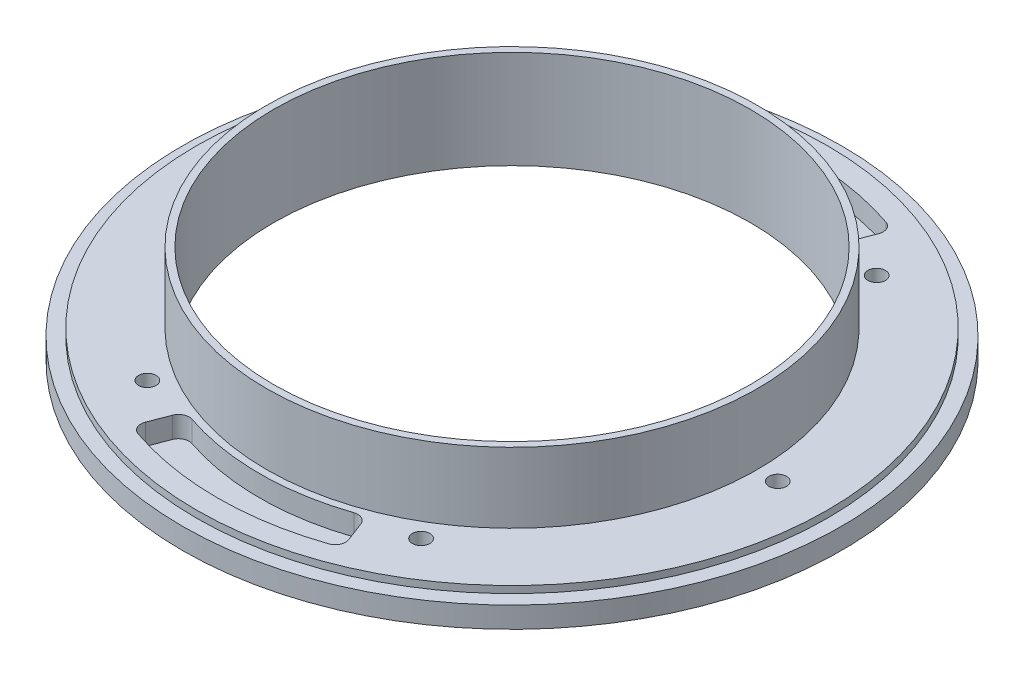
ISO-10303-21;
HEADER;
FILE_DESCRIPTION(('STEP AP214'),'2;1');
FILE_NAME('part.step','',(''),(''),'','','');
FILE_SCHEMA(('AUTOMOTIVE_DESIGN { 1 0 10303 214 1 1 1 1 }'));
ENDSEC;
DATA;
#1=APPLICATION_CONTEXT('core data for automotive mechanical design processes');
#2=APPLICATION_PROTOCOL_DEFINITION('international standard','automotive_design',2000,#1);
#3=PRODUCT_CONTEXT('',#1,'mechanical');
#4=PRODUCT('Part','Part','',(#3));
#5=PRODUCT_RELATED_PRODUCT_CATEGORY('part','',(#4));
#6=PRODUCT_DEFINITION_FORMATION('','',#4);
#7=PRODUCT_DEFINITION_CONTEXT('part definition',#1,'design');
#8=PRODUCT_DEFINITION('design','',#6,#7);
#9=PRODUCT_DEFINITION_SHAPE('','',#8);
#10=(LENGTH_UNIT() NAMED_UNIT(*) SI_UNIT(.MILLI.,.METRE.));
#11=(NAMED_UNIT(*) PLANE_ANGLE_UNIT() SI_UNIT($,.RADIAN.));
#12=(NAMED_UNIT(*) SI_UNIT($,.STERADIAN.) SOLID_ANGLE_UNIT());
#13=UNCERTAINTY_MEASURE_WITH_UNIT(LENGTH_MEASURE(1.E-05),#10,'distance_accuracy_value','');
#14=(GEOMETRIC_REPRESENTATION_CONTEXT(3) GLOBAL_UNCERTAINTY_ASSIGNED_CONTEXT((#13)) GLOBAL_UNIT_ASSIGNED_CONTEXT((#10,
#11,#12)) REPRESENTATION_CONTEXT('',''));
#15=CARTESIAN_POINT('',(0.,0.,0.));
#16=DIRECTION('',(0.,0.,1.));
#17=DIRECTION('',(1.,0.,0.));
#18=AXIS2_PLACEMENT_3D('',#15,#16,#17);
#19=CARTESIAN_POINT('',(-19.5199430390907,0.,-32.4866406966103));
#20=DIRECTION('',(0.,1.,0.));
#21=DIRECTION('',(0.,0.,1.));
#22=AXIS2_PLACEMENT_3D('',#19,#20,#21);
#23=CYLINDRICAL_SURFACE('',#22,1.25);
#24=CARTESIAN_POINT('',(-19.5199430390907,4.,-32.4866406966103));
#25=DIRECTION('',(0.,1.,0.));
#26=DIRECTION('',(0.,0.,1.));
#27=AXIS2_PLACEMENT_3D('',#24,#25,#26);
#28=CIRCLE('',#27,1.25);
#29=CARTESIAN_POINT('',(-19.5199430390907,4.,-31.2366406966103));
#30=VERTEX_POINT('',#29);
#31=EDGE_CURVE('E251',#30,#30,#28,.T.);
#32=ORIENTED_EDGE('',*,*,#31,.T.);
#33=EDGE_LOOP('',(#32));
#34=FACE_BOUND('',#33,.T.);
#35=CARTESIAN_POINT('',(-19.5199430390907,2.,-32.4866406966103));
#36=DIRECTION('',(0.,-1.,0.));
#37=DIRECTION('',(0.,0.,-1.));
#38=AXIS2_PLACEMENT_3D('',#35,#36,#37);
#39=CIRCLE('',#38,1.25);
#40=CARTESIAN_POINT('',(-19.5199430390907,2.,-33.7366406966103));
#41=VERTEX_POINT('',#40);
#42=EDGE_CURVE('E255',#41,#41,#39,.F.);
#43=ORIENTED_EDGE('',*,*,#42,.F.);
#44=EDGE_LOOP('',(#43));
#45=FACE_BOUND('',#44,.T.);
#46=ADVANCED_FACE('F37',(#34,#45),#23,.F.);
#47=CARTESIAN_POINT('',(19.5199430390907,0.,32.4866406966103));
#48=DIRECTION('',(0.,1.,0.));
#49=DIRECTION('',(0.,0.,1.));
#50=AXIS2_PLACEMENT_3D('',#47,#48,#49);
#51=CYLINDRICAL_SURFACE('',#50,1.25);
#52=CARTESIAN_POINT('',(19.5199430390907,4.,32.4866406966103));
#53=DIRECTION('',(0.,1.,0.));
#54=DIRECTION('',(0.,0.,1.));
#55=AXIS2_PLACEMENT_3D('',#52,#53,#54);
#56=CIRCLE('',#55,1.25);
#57=CARTESIAN_POINT('',(19.5199430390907,4.,33.7366406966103));
#58=VERTEX_POINT('',#57);
#59=EDGE_CURVE('E254',#58,#58,#56,.T.);
#60=ORIENTED_EDGE('',*,*,#59,.T.);
#61=EDGE_LOOP('',(#60));
#62=FACE_BOUND('',#61,.T.);
#63=CARTESIAN_POINT('',(19.5199430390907,2.,32.4866406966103));
#64=DIRECTION('',(0.,-1.,0.));
#65=DIRECTION('',(0.,0.,-1.));
#66=AXIS2_PLACEMENT_3D('',#63,#64,#65);
#67=CIRCLE('',#66,1.25);
#68=CARTESIAN_POINT('',(19.5199430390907,2.,31.2366406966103));
#69=VERTEX_POINT('',#68);
#70=EDGE_CURVE('E280',#69,#69,#67,.F.);
#71=ORIENTED_EDGE('',*,*,#70,.F.);
#72=EDGE_LOOP('',(#71));
#73=FACE_BOUND('',#72,.T.);
#74=ADVANCED_FACE('F426',(#62,#73),#51,.F.);
#75=CARTESIAN_POINT('',(19.5199430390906,0.,-32.4866406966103));
#76=DIRECTION('',(0.,1.,0.));
#77=DIRECTION('',(0.,0.,1.));
#78=AXIS2_PLACEMENT_3D('',#75,#76,#77);
#79=CYLINDRICAL_SURFACE('',#78,1.25);
#80=CARTESIAN_POINT('',(19.5199430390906,4.,-32.4866406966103));
#81=DIRECTION('',(0.,1.,0.));
#82=DIRECTION('',(0.,0.,1.));
#83=AXIS2_PLACEMENT_3D('',#80,#81,#82);
#84=CIRCLE('',#83,1.25);
#85=CARTESIAN_POINT('',(19.5199430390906,4.,-31.2366406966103));
#86=VERTEX_POINT('',#85);
#87=EDGE_CURVE('E258',#86,#86,#84,.T.);
#88=ORIENTED_EDGE('',*,*,#87,.T.);
#89=EDGE_LOOP('',(#88));
#90=FACE_BOUND('',#89,.T.);
#91=CARTESIAN_POINT('',(19.5199430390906,2.,-32.4866406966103));
#92=DIRECTION('',(0.,-1.,0.));
#93=DIRECTION('',(0.,0.,-1.));
#94=AXIS2_PLACEMENT_3D('',#91,#92,#93);
#95=CIRCLE('',#94,1.25);
#96=CARTESIAN_POINT('',(19.5199430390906,2.,-33.7366406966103));
#97=VERTEX_POINT('',#96);
#98=EDGE_CURVE('E277',#97,#97,#95,.F.);
#99=ORIENTED_EDGE('',*,*,#98,.F.);
#100=EDGE_LOOP('',(#99));
#101=FACE_BOUND('',#100,.T.);
#102=ADVANCED_FACE('F433',(#90,#101),#79,.F.);
#103=CARTESIAN_POINT('',(-37.9,0.,0.));
#104=DIRECTION('',(0.,1.,0.));
#105=DIRECTION('',(0.,0.,1.));
#106=AXIS2_PLACEMENT_3D('',#103,#104,#105);
#107=CYLINDRICAL_SURFACE('',#106,1.25);
#108=CARTESIAN_POINT('',(-37.9,4.,0.));
#109=DIRECTION('',(0.,1.,0.));
#110=DIRECTION('',(0.,0.,1.));
#111=AXIS2_PLACEMENT_3D('',#108,#109,#110);
#112=CIRCLE('',#111,1.25);
#113=CARTESIAN_POINT('',(-37.9,4.,1.25000000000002));
#114=VERTEX_POINT('',#113);
#115=EDGE_CURVE('E261',#114,#114,#112,.T.);
#116=ORIENTED_EDGE('',*,*,#115,.T.);
#117=EDGE_LOOP('',(#116));
#118=FACE_BOUND('',#117,.T.);
#119=CARTESIAN_POINT('',(-37.9,2.,0.));
#120=DIRECTION('',(0.,-1.,0.));
#121=DIRECTION('',(0.,0.,-1.));
#122=AXIS2_PLACEMENT_3D('',#119,#120,#121);
#123=CIRCLE('',#122,1.25);
#124=CARTESIAN_POINT('',(-37.9,2.,-1.24999999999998));
#125=VERTEX_POINT('',#124);
#126=EDGE_CURVE('E274',#125,#125,#123,.F.);
#127=ORIENTED_EDGE('',*,*,#126,.F.);
#128=EDGE_LOOP('',(#127));
#129=FACE_BOUND('',#128,.T.);
#130=ADVANCED_FACE('F439',(#118,#129),#107,.F.);
#131=CARTESIAN_POINT('',(37.9,0.,0.));
#132=DIRECTION('',(0.,1.,0.));
#133=DIRECTION('',(0.,0.,1.));
#134=AXIS2_PLACEMENT_3D('',#131,#132,#133);
#135=CYLINDRICAL_SURFACE('',#134,1.25);
#136=CARTESIAN_POINT('',(37.9,4.,0.));
#137=DIRECTION('',(0.,1.,0.));
#138=DIRECTION('',(0.,0.,1.));
#139=AXIS2_PLACEMENT_3D('',#136,#137,#138);
#140=CIRCLE('',#139,1.25);
#141=CARTESIAN_POINT('',(37.9,4.,1.24999999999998));
#142=VERTEX_POINT('',#141);
#143=EDGE_CURVE('E264',#142,#142,#140,.T.);
#144=ORIENTED_EDGE('',*,*,#143,.T.);
#145=EDGE_LOOP('',(#144));
#146=FACE_BOUND('',#145,.T.);
#147=CARTESIAN_POINT('',(37.9,2.,0.));
#148=DIRECTION('',(0.,-1.,0.));
#149=DIRECTION('',(0.,0.,-1.));
#150=AXIS2_PLACEMENT_3D('',#147,#148,#149);
#151=CIRCLE('',#150,1.25);
#152=CARTESIAN_POINT('',(37.9,2.,-1.25000000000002));
#153=VERTEX_POINT('',#152);
#154=EDGE_CURVE('E271',#153,#153,#151,.F.);
#155=ORIENTED_EDGE('',*,*,#154,.F.);
#156=EDGE_LOOP('',(#155));
#157=FACE_BOUND('',#156,.T.);
#158=ADVANCED_FACE('F600',(#146,#157),#135,.F.);
#159=CARTESIAN_POINT('',(-19.5199430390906,0.,32.4866406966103));
#160=DIRECTION('',(0.,1.,0.));
#161=DIRECTION('',(0.,0.,1.));
#162=AXIS2_PLACEMENT_3D('',#159,#160,#161);
#163=CYLINDRICAL_SURFACE('',#162,1.25);
#164=CARTESIAN_POINT('',(-19.5199430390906,4.,32.4866406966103));
#165=DIRECTION('',(0.,1.,0.));
#166=DIRECTION('',(0.,0.,1.));
#167=AXIS2_PLACEMENT_3D('',#164,#165,#166);
#168=CIRCLE('',#167,1.25);
#169=CARTESIAN_POINT('',(-19.5199430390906,4.,33.7366406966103));
#170=VERTEX_POINT('',#169);
#171=EDGE_CURVE('E230',#170,#170,#168,.T.);
#172=ORIENTED_EDGE('',*,*,#171,.T.);
#173=EDGE_LOOP('',(#172));
#174=FACE_BOUND('',#173,.T.);
#175=CARTESIAN_POINT('',(-19.5199430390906,2.,32.4866406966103));
#176=DIRECTION('',(0.,-1.,0.));
#177=DIRECTION('',(0.,0.,-1.));
#178=AXIS2_PLACEMENT_3D('',#175,#176,#177);
#179=CIRCLE('',#178,1.25);
#180=CARTESIAN_POINT('',(-19.5199430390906,2.,31.2366406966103));
#181=VERTEX_POINT('',#180);
#182=EDGE_CURVE('E223',#181,#181,#179,.F.);
#183=ORIENTED_EDGE('',*,*,#182,.F.);
#184=EDGE_LOOP('',(#183));
#185=FACE_BOUND('',#184,.T.);
#186=ADVANCED_FACE('F470',(#174,#185),#163,.F.);
#187=CARTESIAN_POINT('',(0.,3.,0.));
#188=DIRECTION('',(0.,-1.,0.));
#189=DIRECTION('',(0.,0.,-1.));
#190=AXIS2_PLACEMENT_3D('',#187,#188,#189);
#191=CYLINDRICAL_SURFACE('',#190,47.);
#192=CARTESIAN_POINT('',(0.,3.,0.));
#193=DIRECTION('',(0.,1.,0.));
#194=DIRECTION('',(0.,0.,1.));
#195=AXIS2_PLACEMENT_3D('',#192,#193,#194);
#196=CIRCLE('',#195,47.);
#197=CARTESIAN_POINT('',(0.,3.,47.));
#198=VERTEX_POINT('',#197);
#199=EDGE_CURVE('E246',#198,#198,#196,.T.);
#200=ORIENTED_EDGE('',*,*,#199,.F.);
#201=EDGE_LOOP('',(#200));
#202=FACE_BOUND('',#201,.T.);
#203=CARTESIAN_POINT('',(0.,0.,0.));
#204=DIRECTION('',(0.,1.,0.));
#205=DIRECTION('',(0.,0.,1.));
#206=AXIS2_PLACEMENT_3D('',#203,#204,#205);
#207=CIRCLE('',#206,47.);
#208=CARTESIAN_POINT('',(0.,0.,47.));
#209=VERTEX_POINT('',#208);
#210=EDGE_CURVE('E242',#209,#209,#207,.T.);
#211=ORIENTED_EDGE('',*,*,#210,.T.);
#212=EDGE_LOOP('',(#211));
#213=FACE_BOUND('',#212,.T.);
#214=ADVANCED_FACE('F463',(#202,#213),#191,.T.);
#215=CARTESIAN_POINT('',(0.,3.,0.));
#216=DIRECTION('',(0.,1.,0.));
#217=DIRECTION('',(0.,0.,1.));
#218=AXIS2_PLACEMENT_3D('',#215,#216,#217);
#219=PLANE('',#218);
#220=CARTESIAN_POINT('',(0.,3.,0.));
#221=DIRECTION('',(0.,1.,0.));
#222=DIRECTION('',(0.,0.,1.));
#223=AXIS2_PLACEMENT_3D('',#220,#221,#222);
#224=CIRCLE('',#223,45.);
#225=CARTESIAN_POINT('',(0.,3.,45.));
#226=VERTEX_POINT('',#225);
#227=EDGE_CURVE('E243',#226,#226,#224,.T.);
#228=ORIENTED_EDGE('',*,*,#227,.F.);
#229=EDGE_LOOP('',(#228));
#230=FACE_BOUND('',#229,.T.);
#231=ORIENTED_EDGE('',*,*,#199,.T.);
#232=EDGE_LOOP('',(#231));
#233=FACE_BOUND('',#232,.T.);
#234=ADVANCED_FACE('F460',(#230,#233),#219,.T.);
#235=CARTESIAN_POINT('',(0.,0.,0.));
#236=DIRECTION('',(0.,1.,0.));
#237=DIRECTION('',(0.,0.,1.));
#238=AXIS2_PLACEMENT_3D('',#235,#236,#237);
#239=PLANE('',#238);
#240=CARTESIAN_POINT('',(19.5199430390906,0.,-32.4866406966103));
#241=DIRECTION('',(0.,-1.,0.));
#242=DIRECTION('',(0.,0.,-1.));
#243=AXIS2_PLACEMENT_3D('',#240,#241,#242);
#244=CIRCLE('',#243,2.25);
#245=CARTESIAN_POINT('',(19.5199430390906,0.,-34.7366406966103));
#246=VERTEX_POINT('',#245);
#247=EDGE_CURVE('E191',#246,#246,#244,.T.);
#248=ORIENTED_EDGE('',*,*,#247,.F.);
#249=EDGE_LOOP('',(#248));
#250=FACE_BOUND('',#249,.T.);
#251=CARTESIAN_POINT('',(37.9,0.,0.));
#252=DIRECTION('',(0.,-1.,0.));
#253=DIRECTION('',(0.,0.,-1.));
#254=AXIS2_PLACEMENT_3D('',#251,#252,#253);
#255=CIRCLE('',#254,2.25);
#256=CARTESIAN_POINT('',(37.9,0.,-2.25000000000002));
#257=VERTEX_POINT('',#256);
#258=EDGE_CURVE('E200',#257,#257,#255,.T.);
#259=ORIENTED_EDGE('',*,*,#258,.F.);
#260=EDGE_LOOP('',(#259));
#261=FACE_BOUND('',#260,.T.);
#262=CARTESIAN_POINT('',(19.5199430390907,0.,32.4866406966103));
#263=DIRECTION('',(0.,-1.,0.));
#264=DIRECTION('',(0.,0.,-1.));
#265=AXIS2_PLACEMENT_3D('',#262,#263,#264);
#266=CIRCLE('',#265,2.25);
#267=CARTESIAN_POINT('',(19.5199430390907,0.,30.2366406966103));
#268=VERTEX_POINT('',#267);
#269=EDGE_CURVE('E199',#268,#268,#266,.T.);
#270=ORIENTED_EDGE('',*,*,#269,.F.);
#271=EDGE_LOOP('',(#270));
#272=FACE_BOUND('',#271,.T.);
#273=CARTESIAN_POINT('',(-37.9,0.,0.));
#274=DIRECTION('',(0.,-1.,0.));
#275=DIRECTION('',(0.,0.,-1.));
#276=AXIS2_PLACEMENT_3D('',#273,#274,#275);
#277=CIRCLE('',#276,2.25);
#278=CARTESIAN_POINT('',(-37.9,0.,-2.24999999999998));
#279=VERTEX_POINT('',#278);
#280=EDGE_CURVE('E212',#279,#279,#277,.T.);
#281=ORIENTED_EDGE('',*,*,#280,.F.);
#282=EDGE_LOOP('',(#281));
#283=FACE_BOUND('',#282,.T.);
#284=CARTESIAN_POINT('',(-19.5199430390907,0.,-32.4866406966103));
#285=DIRECTION('',(0.,-1.,0.));
#286=DIRECTION('',(0.,0.,-1.));
#287=AXIS2_PLACEMENT_3D('',#284,#285,#286);
#288=CIRCLE('',#287,2.25);
#289=CARTESIAN_POINT('',(-19.5199430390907,0.,-34.7366406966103));
#290=VERTEX_POINT('',#289);
#291=EDGE_CURVE('E192',#290,#290,#288,.T.);
#292=ORIENTED_EDGE('',*,*,#291,.F.);
#293=EDGE_LOOP('',(#292));
#294=FACE_BOUND('',#293,.T.);
#295=CARTESIAN_POINT('',(-19.5199430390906,0.,32.4866406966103));
#296=DIRECTION('',(0.,-1.,0.));
#297=DIRECTION('',(0.,0.,-1.));
#298=AXIS2_PLACEMENT_3D('',#295,#296,#297);
#299=CIRCLE('',#298,2.25);
#300=CARTESIAN_POINT('',(-19.5199430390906,0.,30.2366406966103));
#301=VERTEX_POINT('',#300);
#302=EDGE_CURVE('E211',#301,#301,#299,.T.);
#303=ORIENTED_EDGE('',*,*,#302,.F.);
#304=EDGE_LOOP('',(#303));
#305=FACE_BOUND('',#304,.T.);
#306=CARTESIAN_POINT('',(0.,0.,0.));
#307=DIRECTION('',(0.,1.,0.));
#308=DIRECTION('',(0.,0.,1.));
#309=AXIS2_PLACEMENT_3D('',#306,#307,#308);
#310=CIRCLE('',#309,34.);
#311=CARTESIAN_POINT('',(0.,0.,34.));
#312=VERTEX_POINT('',#311);
#313=EDGE_CURVE('E226',#312,#312,#310,.T.);
#314=ORIENTED_EDGE('',*,*,#313,.T.);
#315=EDGE_LOOP('',(#314));
#316=FACE_BOUND('',#315,.T.);
#317=ORIENTED_EDGE('',*,*,#210,.F.);
#318=EDGE_LOOP('',(#317));
#319=FACE_BOUND('',#318,.T.);
#320=ADVANCED_FACE('F458',(#250,#261,#272,#283,#294,#305,#316,#319),#239,.F.);
#321=CARTESIAN_POINT('',(0.,4.,0.));
#322=DIRECTION('',(0.,-1.,0.));
#323=DIRECTION('',(0.,0.,-1.));
#324=AXIS2_PLACEMENT_3D('',#321,#322,#323);
#325=CYLINDRICAL_SURFACE('',#324,45.);
#326=CARTESIAN_POINT('',(0.,4.,0.));
#327=DIRECTION('',(0.,1.,0.));
#328=DIRECTION('',(0.,0.,1.));
#329=AXIS2_PLACEMENT_3D('',#326,#327,#328);
#330=CIRCLE('',#329,45.);
#331=CARTESIAN_POINT('',(0.,4.,45.));
#332=VERTEX_POINT('',#331);
#333=EDGE_CURVE('E237',#332,#332,#330,.T.);
#334=ORIENTED_EDGE('',*,*,#333,.F.);
#335=EDGE_LOOP('',(#334));
#336=FACE_BOUND('',#335,.T.);
#337=ORIENTED_EDGE('',*,*,#227,.T.);
#338=EDGE_LOOP('',(#337));
#339=FACE_BOUND('',#338,.T.);
#340=ADVANCED_FACE('F455',(#336,#339),#325,.T.);
#341=CARTESIAN_POINT('',(0.,4.,0.));
#342=DIRECTION('',(0.,1.,0.));
#343=DIRECTION('',(0.,0.,1.));
#344=AXIS2_PLACEMENT_3D('',#341,#342,#343);
#345=PLANE('',#344);
#346=DIRECTION('',(0.358367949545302,0.,-0.933580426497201));
#347=VECTOR('',#346,1.);
#348=CARTESIAN_POINT('',(0.,4.,0.));
#349=LINE('',#348,#347);
#350=CARTESIAN_POINT('',(13.4280427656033,4.,-34.9812473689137));
#351=VERTEX_POINT('',#350);
#352=CARTESIAN_POINT('',(14.5039438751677,4.,-37.7840655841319));
#353=VERTEX_POINT('',#352);
#354=EDGE_CURVE('E344',#351,#353,#349,.T.);
#355=ORIENTED_EDGE('',*,*,#354,.F.);
#356=CARTESIAN_POINT('',(12.0276721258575,4.,-35.5187992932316));
#357=DIRECTION('',(0.,1.,0.));
#358=DIRECTION('',(0.,0.,1.));
#359=AXIS2_PLACEMENT_3D('',#356,#357,#358);
#360=CIRCLE('',#359,1.5);
#361=CARTESIAN_POINT('',(11.5465652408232,4.,-34.0980473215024));
#362=VERTEX_POINT('',#361);
#363=EDGE_CURVE('E45',#351,#362,#360,.F.);
#364=ORIENTED_EDGE('',*,*,#363,.T.);
#365=CARTESIAN_POINT('',(0.,4.,0.));
#366=DIRECTION('',(0.,1.,0.));
#367=DIRECTION('',(0.,0.,1.));
#368=AXIS2_PLACEMENT_3D('',#365,#366,#367);
#369=CIRCLE('',#368,36.);
#370=CARTESIAN_POINT('',(-11.5465652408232,4.,-34.0980473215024));
#371=VERTEX_POINT('',#370);
#372=EDGE_CURVE('E342',#362,#371,#369,.T.);
#373=ORIENTED_EDGE('',*,*,#372,.T.);
#374=CARTESIAN_POINT('',(-12.0276721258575,4.,-35.5187992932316));
#375=DIRECTION('',(0.,1.,0.));
#376=DIRECTION('',(0.,0.,1.));
#377=AXIS2_PLACEMENT_3D('',#374,#375,#376);
#378=CIRCLE('',#377,1.5);
#379=CARTESIAN_POINT('',(-13.4280427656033,4.,-34.9812473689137));
#380=VERTEX_POINT('',#379);
#381=EDGE_CURVE('E58',#371,#380,#378,.F.);
#382=ORIENTED_EDGE('',*,*,#381,.T.);
#383=DIRECTION('',(-0.358367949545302,0.,-0.933580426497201));
#384=VECTOR('',#383,1.);
#385=CARTESIAN_POINT('',(0.,4.,0.));
#386=LINE('',#385,#384);
#387=CARTESIAN_POINT('',(-14.5039438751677,4.,-37.7840655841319));
#388=VERTEX_POINT('',#387);
#389=EDGE_CURVE('E354',#380,#388,#386,.T.);
#390=ORIENTED_EDGE('',*,*,#389,.T.);
#391=CARTESIAN_POINT('',(-13.1035732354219,4.,-38.3216175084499));
#392=DIRECTION('',(0.,1.,0.));
#393=DIRECTION('',(0.,0.,1.));
#394=AXIS2_PLACEMENT_3D('',#391,#392,#393);
#395=CIRCLE('',#394,1.5);
#396=CARTESIAN_POINT('',(-13.5888907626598,4.,-39.7409366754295));
#397=VERTEX_POINT('',#396);
#398=EDGE_CURVE('E11',#388,#397,#395,.F.);
#399=ORIENTED_EDGE('',*,*,#398,.T.);
#400=CARTESIAN_POINT('',(0.,4.,0.));
#401=DIRECTION('',(0.,1.,0.));
#402=DIRECTION('',(0.,0.,1.));
#403=AXIS2_PLACEMENT_3D('',#400,#401,#402);
#404=CIRCLE('',#403,42.);
#405=CARTESIAN_POINT('',(13.5888907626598,4.,-39.7409366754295));
#406=VERTEX_POINT('',#405);
#407=EDGE_CURVE('E376',#406,#397,#404,.T.);
#408=ORIENTED_EDGE('',*,*,#407,.F.);
#409=CARTESIAN_POINT('',(13.1035732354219,4.,-38.3216175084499));
#410=DIRECTION('',(0.,1.,0.));
#411=DIRECTION('',(0.,0.,1.));
#412=AXIS2_PLACEMENT_3D('',#409,#410,#411);
#413=CIRCLE('',#412,1.5);
#414=EDGE_CURVE('E338',#406,#353,#413,.F.);
#415=ORIENTED_EDGE('',*,*,#414,.T.);
#416=EDGE_LOOP('',(#355,#364,#373,#382,#390,#399,#408,#415));
#417=FACE_BOUND('',#416,.T.);
#418=DIRECTION('',(-0.358367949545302,0.,0.933580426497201));
#419=VECTOR('',#418,1.);
#420=CARTESIAN_POINT('',(0.,4.,0.));
#421=LINE('',#420,#419);
#422=CARTESIAN_POINT('',(-13.4280427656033,4.,34.9812473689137));
#423=VERTEX_POINT('',#422);
#424=CARTESIAN_POINT('',(-14.5039438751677,4.,37.7840655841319));
#425=VERTEX_POINT('',#424);
#426=EDGE_CURVE('E178',#423,#425,#421,.T.);
#427=ORIENTED_EDGE('',*,*,#426,.F.);
#428=CARTESIAN_POINT('',(-12.0276721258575,4.,35.5187992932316));
#429=DIRECTION('',(0.,1.,0.));
#430=DIRECTION('',(0.,0.,1.));
#431=AXIS2_PLACEMENT_3D('',#428,#429,#430);
#432=CIRCLE('',#431,1.5);
#433=CARTESIAN_POINT('',(-11.5465652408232,4.,34.0980473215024));
#434=VERTEX_POINT('',#433);
#435=EDGE_CURVE('E336',#423,#434,#432,.F.);
#436=ORIENTED_EDGE('',*,*,#435,.T.);
#437=CARTESIAN_POINT('',(0.,4.,0.));
#438=DIRECTION('',(0.,1.,0.));
#439=DIRECTION('',(0.,0.,1.));
#440=AXIS2_PLACEMENT_3D('',#437,#438,#439);
#441=CIRCLE('',#440,36.);
#442=CARTESIAN_POINT('',(11.5465652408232,4.,34.0980473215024));
#443=VERTEX_POINT('',#442);
#444=EDGE_CURVE('E180',#434,#443,#441,.T.);
#445=ORIENTED_EDGE('',*,*,#444,.T.);
#446=CARTESIAN_POINT('',(12.0276721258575,4.,35.5187992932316));
#447=DIRECTION('',(0.,1.,0.));
#448=DIRECTION('',(0.,0.,1.));
#449=AXIS2_PLACEMENT_3D('',#446,#447,#448);
#450=CIRCLE('',#449,1.5);
#451=CARTESIAN_POINT('',(13.4280427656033,4.,34.9812473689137));
#452=VERTEX_POINT('',#451);
#453=EDGE_CURVE('E334',#443,#452,#450,.F.);
#454=ORIENTED_EDGE('',*,*,#453,.T.);
#455=DIRECTION('',(0.358367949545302,0.,0.933580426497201));
#456=VECTOR('',#455,1.);
#457=CARTESIAN_POINT('',(0.,4.,0.));
#458=LINE('',#457,#456);
#459=CARTESIAN_POINT('',(14.5039438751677,4.,37.7840655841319));
#460=VERTEX_POINT('',#459);
#461=EDGE_CURVE('E177',#452,#460,#458,.T.);
#462=ORIENTED_EDGE('',*,*,#461,.T.);
#463=CARTESIAN_POINT('',(13.1035732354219,4.,38.3216175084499));
#464=DIRECTION('',(0.,1.,0.));
#465=DIRECTION('',(0.,0.,1.));
#466=AXIS2_PLACEMENT_3D('',#463,#464,#465);
#467=CIRCLE('',#466,1.5);
#468=CARTESIAN_POINT('',(13.5888907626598,4.,39.7409366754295));
#469=VERTEX_POINT('',#468);
#470=EDGE_CURVE('E160',#460,#469,#467,.F.);
#471=ORIENTED_EDGE('',*,*,#470,.T.);
#472=CARTESIAN_POINT('',(0.,4.,0.));
#473=DIRECTION('',(0.,1.,0.));
#474=DIRECTION('',(0.,0.,1.));
#475=AXIS2_PLACEMENT_3D('',#472,#473,#474);
#476=CIRCLE('',#475,42.);
#477=CARTESIAN_POINT('',(-13.5888907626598,4.,39.7409366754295));
#478=VERTEX_POINT('',#477);
#479=EDGE_CURVE('E167',#478,#469,#476,.T.);
#480=ORIENTED_EDGE('',*,*,#479,.F.);
#481=CARTESIAN_POINT('',(-13.1035732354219,4.,38.3216175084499));
#482=DIRECTION('',(0.,1.,0.));
#483=DIRECTION('',(0.,0.,1.));
#484=AXIS2_PLACEMENT_3D('',#481,#482,#483);
#485=CIRCLE('',#484,1.5);
#486=EDGE_CURVE('E150',#478,#425,#485,.F.);
#487=ORIENTED_EDGE('',*,*,#486,.T.);
#488=EDGE_LOOP('',(#427,#436,#445,#454,#462,#471,#480,#487));
#489=FACE_BOUND('',#488,.T.);
#490=ORIENTED_EDGE('',*,*,#171,.F.);
#491=EDGE_LOOP('',(#490));
#492=FACE_BOUND('',#491,.T.);
#493=ORIENTED_EDGE('',*,*,#143,.F.);
#494=EDGE_LOOP('',(#493));
#495=FACE_BOUND('',#494,.T.);
#496=ORIENTED_EDGE('',*,*,#115,.F.);
#497=EDGE_LOOP('',(#496));
#498=FACE_BOUND('',#497,.T.);
#499=ORIENTED_EDGE('',*,*,#87,.F.);
#500=EDGE_LOOP('',(#499));
#501=FACE_BOUND('',#500,.T.);
#502=ORIENTED_EDGE('',*,*,#59,.F.);
#503=EDGE_LOOP('',(#502));
#504=FACE_BOUND('',#503,.T.);
#505=ORIENTED_EDGE('',*,*,#31,.F.);
#506=EDGE_LOOP('',(#505));
#507=FACE_BOUND('',#506,.T.);
#508=CARTESIAN_POINT('',(0.,4.,0.));
#509=DIRECTION('',(0.,1.,0.));
#510=DIRECTION('',(0.,0.,1.));
#511=AXIS2_PLACEMENT_3D('',#508,#509,#510);
#512=CIRCLE('',#511,35.);
#513=CARTESIAN_POINT('',(0.,4.,35.));
#514=VERTEX_POINT('',#513);
#515=EDGE_CURVE('E233',#514,#514,#512,.T.);
#516=ORIENTED_EDGE('',*,*,#515,.F.);
#517=EDGE_LOOP('',(#516));
#518=FACE_BOUND('',#517,.T.);
#519=ORIENTED_EDGE('',*,*,#333,.T.);
#520=EDGE_LOOP('',(#519));
#521=FACE_BOUND('',#520,.T.);
#522=ADVANCED_FACE('F174',(#417,#489,#492,#495,#498,#501,#504,#507,#518,#521),#345,.T.);
#523=CARTESIAN_POINT('',(0.,14.,0.));
#524=DIRECTION('',(0.,1.,0.));
#525=DIRECTION('',(0.,0.,1.));
#526=AXIS2_PLACEMENT_3D('',#523,#524,#525);
#527=PLANE('',#526);
#528=CARTESIAN_POINT('',(0.,14.,0.));
#529=DIRECTION('',(0.,1.,0.));
#530=DIRECTION('',(0.,0.,1.));
#531=AXIS2_PLACEMENT_3D('',#528,#529,#530);
#532=CIRCLE('',#531,35.);
#533=CARTESIAN_POINT('',(0.,14.,35.));
#534=VERTEX_POINT('',#533);
#535=EDGE_CURVE('E234',#534,#534,#532,.T.);
#536=ORIENTED_EDGE('',*,*,#535,.T.);
#537=EDGE_LOOP('',(#536));
#538=FACE_BOUND('',#537,.T.);
#539=CARTESIAN_POINT('',(0.,14.,0.));
#540=DIRECTION('',(0.,1.,0.));
#541=DIRECTION('',(0.,0.,1.));
#542=AXIS2_PLACEMENT_3D('',#539,#540,#541);
#543=CIRCLE('',#542,34.);
#544=CARTESIAN_POINT('',(0.,14.,34.));
#545=VERTEX_POINT('',#544);
#546=EDGE_CURVE('E229',#545,#545,#543,.T.);
#547=ORIENTED_EDGE('',*,*,#546,.F.);
#548=EDGE_LOOP('',(#547));
#549=FACE_BOUND('',#548,.T.);
#550=ADVANCED_FACE('F446',(#538,#549),#527,.T.);
#551=CARTESIAN_POINT('',(0.,14.,0.));
#552=DIRECTION('',(0.,-1.,0.));
#553=DIRECTION('',(0.,0.,-1.));
#554=AXIS2_PLACEMENT_3D('',#551,#552,#553);
#555=CYLINDRICAL_SURFACE('',#554,35.);
#556=ORIENTED_EDGE('',*,*,#535,.F.);
#557=EDGE_LOOP('',(#556));
#558=FACE_BOUND('',#557,.T.);
#559=ORIENTED_EDGE('',*,*,#515,.T.);
#560=EDGE_LOOP('',(#559));
#561=FACE_BOUND('',#560,.T.);
#562=ADVANCED_FACE('F444',(#558,#561),#555,.T.);
#563=CARTESIAN_POINT('',(0.,14.,0.));
#564=DIRECTION('',(0.,-1.,0.));
#565=DIRECTION('',(0.,0.,-1.));
#566=AXIS2_PLACEMENT_3D('',#563,#564,#565);
#567=CYLINDRICAL_SURFACE('',#566,34.);
#568=ORIENTED_EDGE('',*,*,#546,.T.);
#569=EDGE_LOOP('',(#568));
#570=FACE_BOUND('',#569,.T.);
#571=ORIENTED_EDGE('',*,*,#313,.F.);
#572=EDGE_LOOP('',(#571));
#573=FACE_BOUND('',#572,.T.);
#574=ADVANCED_FACE('F441',(#570,#573),#567,.F.);
#575=CARTESIAN_POINT('',(-19.5199430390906,2.,32.4866406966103));
#576=DIRECTION('',(0.,-1.,0.));
#577=DIRECTION('',(0.,0.,-1.));
#578=AXIS2_PLACEMENT_3D('',#575,#576,#577);
#579=PLANE('',#578);
#580=CARTESIAN_POINT('',(-19.5199430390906,2.,32.4866406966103));
#581=DIRECTION('',(0.,-1.,0.));
#582=DIRECTION('',(0.,0.,-1.));
#583=AXIS2_PLACEMENT_3D('',#580,#581,#582);
#584=CIRCLE('',#583,2.25);
#585=CARTESIAN_POINT('',(-19.5199430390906,2.,30.2366406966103));
#586=VERTEX_POINT('',#585);
#587=EDGE_CURVE('E220',#586,#586,#584,.T.);
#588=ORIENTED_EDGE('',*,*,#587,.T.);
#589=EDGE_LOOP('',(#588));
#590=FACE_BOUND('',#589,.T.);
#591=ORIENTED_EDGE('',*,*,#182,.T.);
#592=EDGE_LOOP('',(#591));
#593=FACE_BOUND('',#592,.T.);
#594=ADVANCED_FACE('F443',(#590,#593),#579,.T.);
#595=CARTESIAN_POINT('',(-19.5199430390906,2.,32.4866406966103));
#596=DIRECTION('',(0.,-1.,0.));
#597=DIRECTION('',(0.,0.,-1.));
#598=AXIS2_PLACEMENT_3D('',#595,#596,#597);
#599=CYLINDRICAL_SURFACE('',#598,2.25);
#600=ORIENTED_EDGE('',*,*,#587,.F.);
#601=EDGE_LOOP('',(#600));
#602=FACE_BOUND('',#601,.T.);
#603=ORIENTED_EDGE('',*,*,#302,.T.);
#604=EDGE_LOOP('',(#603));
#605=FACE_BOUND('',#604,.T.);
#606=ADVANCED_FACE('F566',(#602,#605),#599,.F.);
#607=CARTESIAN_POINT('',(37.9,2.,0.));
#608=DIRECTION('',(0.,-1.,0.));
#609=DIRECTION('',(0.,0.,-1.));
#610=AXIS2_PLACEMENT_3D('',#607,#608,#609);
#611=PLANE('',#610);
#612=CARTESIAN_POINT('',(37.9,2.,0.));
#613=DIRECTION('',(0.,-1.,0.));
#614=DIRECTION('',(0.,0.,-1.));
#615=AXIS2_PLACEMENT_3D('',#612,#613,#614);
#616=CIRCLE('',#615,2.25);
#617=CARTESIAN_POINT('',(37.9,2.,-2.25000000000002));
#618=VERTEX_POINT('',#617);
#619=EDGE_CURVE('E196',#618,#618,#616,.T.);
#620=ORIENTED_EDGE('',*,*,#619,.T.);
#621=EDGE_LOOP('',(#620));
#622=FACE_BOUND('',#621,.T.);
#623=ORIENTED_EDGE('',*,*,#154,.T.);
#624=EDGE_LOOP('',(#623));
#625=FACE_BOUND('',#624,.T.);
#626=ADVANCED_FACE('F562',(#622,#625),#611,.T.);
#627=CARTESIAN_POINT('',(37.9,2.,0.));
#628=DIRECTION('',(0.,-1.,0.));
#629=DIRECTION('',(0.,0.,-1.));
#630=AXIS2_PLACEMENT_3D('',#627,#628,#629);
#631=CYLINDRICAL_SURFACE('',#630,2.25);
#632=ORIENTED_EDGE('',*,*,#619,.F.);
#633=EDGE_LOOP('',(#632));
#634=FACE_BOUND('',#633,.T.);
#635=ORIENTED_EDGE('',*,*,#258,.T.);
#636=EDGE_LOOP('',(#635));
#637=FACE_BOUND('',#636,.T.);
#638=ADVANCED_FACE('F565',(#634,#637),#631,.F.);
#639=CARTESIAN_POINT('',(-37.9,2.,0.));
#640=DIRECTION('',(0.,-1.,0.));
#641=DIRECTION('',(0.,0.,-1.));
#642=AXIS2_PLACEMENT_3D('',#639,#640,#641);
#643=PLANE('',#642);
#644=CARTESIAN_POINT('',(-37.9,2.,0.));
#645=DIRECTION('',(0.,-1.,0.));
#646=DIRECTION('',(0.,0.,-1.));
#647=AXIS2_PLACEMENT_3D('',#644,#645,#646);
#648=CIRCLE('',#647,2.25);
#649=CARTESIAN_POINT('',(-37.9,2.,-2.24999999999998));
#650=VERTEX_POINT('',#649);
#651=EDGE_CURVE('E208',#650,#650,#648,.T.);
#652=ORIENTED_EDGE('',*,*,#651,.T.);
#653=EDGE_LOOP('',(#652));
#654=FACE_BOUND('',#653,.T.);
#655=ORIENTED_EDGE('',*,*,#126,.T.);
#656=EDGE_LOOP('',(#655));
#657=FACE_BOUND('',#656,.T.);
#658=ADVANCED_FACE('F570',(#654,#657),#643,.T.);
#659=CARTESIAN_POINT('',(-37.9,2.,0.));
#660=DIRECTION('',(0.,-1.,0.));
#661=DIRECTION('',(0.,0.,-1.));
#662=AXIS2_PLACEMENT_3D('',#659,#660,#661);
#663=CYLINDRICAL_SURFACE('',#662,2.25);
#664=ORIENTED_EDGE('',*,*,#651,.F.);
#665=EDGE_LOOP('',(#664));
#666=FACE_BOUND('',#665,.T.);
#667=ORIENTED_EDGE('',*,*,#280,.T.);
#668=EDGE_LOOP('',(#667));
#669=FACE_BOUND('',#668,.T.);
#670=ADVANCED_FACE('F576',(#666,#669),#663,.F.);
#671=CARTESIAN_POINT('',(19.5199430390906,2.,-32.4866406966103));
#672=DIRECTION('',(0.,-1.,0.));
#673=DIRECTION('',(0.,0.,-1.));
#674=AXIS2_PLACEMENT_3D('',#671,#672,#673);
#675=PLANE('',#674);
#676=CARTESIAN_POINT('',(19.5199430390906,2.,-32.4866406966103));
#677=DIRECTION('',(0.,-1.,0.));
#678=DIRECTION('',(0.,0.,-1.));
#679=AXIS2_PLACEMENT_3D('',#676,#677,#678);
#680=CIRCLE('',#679,2.25);
#681=CARTESIAN_POINT('',(19.5199430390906,2.,-34.7366406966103));
#682=VERTEX_POINT('',#681);
#683=EDGE_CURVE('E203',#682,#682,#680,.T.);
#684=ORIENTED_EDGE('',*,*,#683,.T.);
#685=EDGE_LOOP('',(#684));
#686=FACE_BOUND('',#685,.T.);
#687=ORIENTED_EDGE('',*,*,#98,.T.);
#688=EDGE_LOOP('',(#687));
#689=FACE_BOUND('',#688,.T.);
#690=ADVANCED_FACE('F572',(#686,#689),#675,.T.);
#691=CARTESIAN_POINT('',(19.5199430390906,2.,-32.4866406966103));
#692=DIRECTION('',(0.,-1.,0.));
#693=DIRECTION('',(0.,0.,-1.));
#694=AXIS2_PLACEMENT_3D('',#691,#692,#693);
#695=CYLINDRICAL_SURFACE('',#694,2.25);
#696=ORIENTED_EDGE('',*,*,#683,.F.);
#697=EDGE_LOOP('',(#696));
#698=FACE_BOUND('',#697,.T.);
#699=ORIENTED_EDGE('',*,*,#247,.T.);
#700=EDGE_LOOP('',(#699));
#701=FACE_BOUND('',#700,.T.);
#702=ADVANCED_FACE('F575',(#698,#701),#695,.F.);
#703=CARTESIAN_POINT('',(19.5199430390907,2.,32.4866406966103));
#704=DIRECTION('',(0.,-1.,0.));
#705=DIRECTION('',(0.,0.,-1.));
#706=AXIS2_PLACEMENT_3D('',#703,#704,#705);
#707=PLANE('',#706);
#708=CARTESIAN_POINT('',(19.5199430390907,2.,32.4866406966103));
#709=DIRECTION('',(0.,-1.,0.));
#710=DIRECTION('',(0.,0.,-1.));
#711=AXIS2_PLACEMENT_3D('',#708,#709,#710);
#712=CIRCLE('',#711,2.25);
#713=CARTESIAN_POINT('',(19.5199430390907,2.,30.2366406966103));
#714=VERTEX_POINT('',#713);
#715=EDGE_CURVE('E215',#714,#714,#712,.T.);
#716=ORIENTED_EDGE('',*,*,#715,.T.);
#717=EDGE_LOOP('',(#716));
#718=FACE_BOUND('',#717,.T.);
#719=ORIENTED_EDGE('',*,*,#70,.T.);
#720=EDGE_LOOP('',(#719));
#721=FACE_BOUND('',#720,.T.);
#722=ADVANCED_FACE('F580',(#718,#721),#707,.T.);
#723=CARTESIAN_POINT('',(19.5199430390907,2.,32.4866406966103));
#724=DIRECTION('',(0.,-1.,0.));
#725=DIRECTION('',(0.,0.,-1.));
#726=AXIS2_PLACEMENT_3D('',#723,#724,#725);
#727=CYLINDRICAL_SURFACE('',#726,2.25);
#728=ORIENTED_EDGE('',*,*,#715,.F.);
#729=EDGE_LOOP('',(#728));
#730=FACE_BOUND('',#729,.T.);
#731=ORIENTED_EDGE('',*,*,#269,.T.);
#732=EDGE_LOOP('',(#731));
#733=FACE_BOUND('',#732,.T.);
#734=ADVANCED_FACE('F557',(#730,#733),#727,.F.);
#735=CARTESIAN_POINT('',(-19.5199430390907,2.,-32.4866406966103));
#736=DIRECTION('',(0.,-1.,0.));
#737=DIRECTION('',(0.,0.,-1.));
#738=AXIS2_PLACEMENT_3D('',#735,#736,#737);
#739=PLANE('',#738);
#740=CARTESIAN_POINT('',(-19.5199430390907,2.,-32.4866406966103));
#741=DIRECTION('',(0.,-1.,0.));
#742=DIRECTION('',(0.,0.,-1.));
#743=AXIS2_PLACEMENT_3D('',#740,#741,#742);
#744=CIRCLE('',#743,2.25);
#745=CARTESIAN_POINT('',(-19.5199430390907,2.,-34.7366406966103));
#746=VERTEX_POINT('',#745);
#747=EDGE_CURVE('E188',#746,#746,#744,.T.);
#748=ORIENTED_EDGE('',*,*,#747,.T.);
#749=EDGE_LOOP('',(#748));
#750=FACE_BOUND('',#749,.T.);
#751=ORIENTED_EDGE('',*,*,#42,.T.);
#752=EDGE_LOOP('',(#751));
#753=FACE_BOUND('',#752,.T.);
#754=ADVANCED_FACE('F554',(#750,#753),#739,.T.);
#755=CARTESIAN_POINT('',(-19.5199430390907,2.,-32.4866406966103));
#756=DIRECTION('',(0.,-1.,0.));
#757=DIRECTION('',(0.,0.,-1.));
#758=AXIS2_PLACEMENT_3D('',#755,#756,#757);
#759=CYLINDRICAL_SURFACE('',#758,2.25);
#760=ORIENTED_EDGE('',*,*,#747,.F.);
#761=EDGE_LOOP('',(#760));
#762=FACE_BOUND('',#761,.T.);
#763=ORIENTED_EDGE('',*,*,#291,.T.);
#764=EDGE_LOOP('',(#763));
#765=FACE_BOUND('',#764,.T.);
#766=ADVANCED_FACE('F553',(#762,#765),#759,.F.);
#767=CARTESIAN_POINT('',(0.,1.,0.));
#768=DIRECTION('',(-0.933580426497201,0.,-0.358367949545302));
#769=DIRECTION('',(-0.358367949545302,0.,0.933580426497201));
#770=AXIS2_PLACEMENT_3D('',#767,#768,#769);
#771=PLANE('',#770);
#772=ORIENTED_EDGE('',*,*,#426,.T.);
#773=DIRECTION('',(0.,-1.,0.));
#774=VECTOR('',#773,1.);
#775=CARTESIAN_POINT('',(-14.5039438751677,1.,37.7840655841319));
#776=LINE('',#775,#774);
#777=CARTESIAN_POINT('',(-14.5039438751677,1.,37.7840655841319));
#778=VERTEX_POINT('',#777);
#779=EDGE_CURVE('E155',#425,#778,#776,.T.);
#780=ORIENTED_EDGE('',*,*,#779,.T.);
#781=DIRECTION('',(-0.358367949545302,0.,0.933580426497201));
#782=VECTOR('',#781,1.);
#783=CARTESIAN_POINT('',(0.,1.,0.));
#784=LINE('',#783,#782);
#785=CARTESIAN_POINT('',(-13.4280427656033,1.,34.9812473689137));
#786=VERTEX_POINT('',#785);
#787=EDGE_CURVE('E187',#786,#778,#784,.T.);
#788=ORIENTED_EDGE('',*,*,#787,.F.);
#789=DIRECTION('',(0.,1.,0.));
#790=VECTOR('',#789,1.);
#791=CARTESIAN_POINT('',(-13.4280427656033,1.,34.9812473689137));
#792=LINE('',#791,#790);
#793=EDGE_CURVE('E171',#786,#423,#792,.T.);
#794=ORIENTED_EDGE('',*,*,#793,.T.);
#795=EDGE_LOOP('',(#772,#780,#788,#794));
#796=FACE_BOUND('',#795,.T.);
#797=ADVANCED_FACE('F411',(#796),#771,.F.);
#798=CARTESIAN_POINT('',(0.,1.,0.));
#799=DIRECTION('',(0.,1.,0.));
#800=DIRECTION('',(0.,0.,1.));
#801=AXIS2_PLACEMENT_3D('',#798,#799,#800);
#802=CYLINDRICAL_SURFACE('',#801,36.);
#803=CARTESIAN_POINT('',(0.,1.,0.));
#804=DIRECTION('',(0.,1.,0.));
#805=DIRECTION('',(0.,0.,1.));
#806=AXIS2_PLACEMENT_3D('',#803,#804,#805);
#807=CIRCLE('',#806,36.);
#808=CARTESIAN_POINT('',(-11.5465652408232,1.,34.0980473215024));
#809=VERTEX_POINT('',#808);
#810=CARTESIAN_POINT('',(11.5465652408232,1.,34.0980473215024));
#811=VERTEX_POINT('',#810);
#812=EDGE_CURVE('E377',#809,#811,#807,.T.);
#813=ORIENTED_EDGE('',*,*,#812,.T.);
#814=DIRECTION('',(0.,1.,0.));
#815=VECTOR('',#814,1.);
#816=CARTESIAN_POINT('',(11.5465652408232,1.,34.0980473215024));
#817=LINE('',#816,#815);
#818=EDGE_CURVE('E304',#811,#443,#817,.T.);
#819=ORIENTED_EDGE('',*,*,#818,.T.);
#820=ORIENTED_EDGE('',*,*,#444,.F.);
#821=DIRECTION('',(0.,1.,0.));
#822=VECTOR('',#821,1.);
#823=CARTESIAN_POINT('',(-11.5465652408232,1.,34.0980473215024));
#824=LINE('',#823,#822);
#825=EDGE_CURVE('E302',#434,#809,#824,.F.);
#826=ORIENTED_EDGE('',*,*,#825,.T.);
#827=EDGE_LOOP('',(#813,#819,#820,#826));
#828=FACE_BOUND('',#827,.T.);
#829=ADVANCED_FACE('F390',(#828),#802,.T.);
#830=CARTESIAN_POINT('',(0.,1.,0.));
#831=DIRECTION('',(-0.933580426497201,0.,0.358367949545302));
#832=DIRECTION('',(0.358367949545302,0.,0.933580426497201));
#833=AXIS2_PLACEMENT_3D('',#830,#831,#832);
#834=PLANE('',#833);
#835=DIRECTION('',(0.358367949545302,0.,0.933580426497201));
#836=VECTOR('',#835,1.);
#837=CARTESIAN_POINT('',(0.,1.,0.));
#838=LINE('',#837,#836);
#839=CARTESIAN_POINT('',(13.4280427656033,1.,34.9812473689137));
#840=VERTEX_POINT('',#839);
#841=CARTESIAN_POINT('',(14.5039438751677,1.,37.7840655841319));
#842=VERTEX_POINT('',#841);
#843=EDGE_CURVE('E384',#840,#842,#838,.T.);
#844=ORIENTED_EDGE('',*,*,#843,.T.);
#845=DIRECTION('',(0.,1.,0.));
#846=VECTOR('',#845,1.);
#847=CARTESIAN_POINT('',(14.5039438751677,1.,37.7840655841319));
#848=LINE('',#847,#846);
#849=EDGE_CURVE('E299',#842,#460,#848,.T.);
#850=ORIENTED_EDGE('',*,*,#849,.T.);
#851=ORIENTED_EDGE('',*,*,#461,.F.);
#852=DIRECTION('',(0.,-1.,0.));
#853=VECTOR('',#852,1.);
#854=CARTESIAN_POINT('',(13.4280427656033,1.,34.9812473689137));
#855=LINE('',#854,#853);
#856=EDGE_CURVE('E297',#452,#840,#855,.T.);
#857=ORIENTED_EDGE('',*,*,#856,.T.);
#858=EDGE_LOOP('',(#844,#850,#851,#857));
#859=FACE_BOUND('',#858,.T.);
#860=ADVANCED_FACE('F401',(#859),#834,.T.);
#861=CARTESIAN_POINT('',(0.,1.,0.));
#862=DIRECTION('',(0.,1.,0.));
#863=DIRECTION('',(0.,0.,1.));
#864=AXIS2_PLACEMENT_3D('',#861,#862,#863);
#865=CYLINDRICAL_SURFACE('',#864,42.);
#866=CARTESIAN_POINT('',(0.,1.,0.));
#867=DIRECTION('',(0.,1.,0.));
#868=DIRECTION('',(0.,0.,1.));
#869=AXIS2_PLACEMENT_3D('',#866,#867,#868);
#870=CIRCLE('',#869,42.);
#871=CARTESIAN_POINT('',(-13.5888907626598,1.,39.7409366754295));
#872=VERTEX_POINT('',#871);
#873=CARTESIAN_POINT('',(13.5888907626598,1.,39.7409366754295));
#874=VERTEX_POINT('',#873);
#875=EDGE_CURVE('E170',#872,#874,#870,.T.);
#876=ORIENTED_EDGE('',*,*,#875,.F.);
#877=DIRECTION('',(0.,1.,0.));
#878=VECTOR('',#877,1.);
#879=CARTESIAN_POINT('',(-13.5888907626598,1.,39.7409366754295));
#880=LINE('',#879,#878);
#881=EDGE_CURVE('E154',#872,#478,#880,.T.);
#882=ORIENTED_EDGE('',*,*,#881,.T.);
#883=ORIENTED_EDGE('',*,*,#479,.T.);
#884=DIRECTION('',(0.,1.,0.));
#885=VECTOR('',#884,1.);
#886=CARTESIAN_POINT('',(13.5888907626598,1.,39.7409366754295));
#887=LINE('',#886,#885);
#888=EDGE_CURVE('E172',#469,#874,#887,.F.);
#889=ORIENTED_EDGE('',*,*,#888,.T.);
#890=EDGE_LOOP('',(#876,#882,#883,#889));
#891=FACE_BOUND('',#890,.T.);
#892=ADVANCED_FACE('F166',(#891),#865,.F.);
#893=CARTESIAN_POINT('',(0.,1.,0.));
#894=DIRECTION('',(0.,1.,0.));
#895=DIRECTION('',(0.,0.,1.));
#896=AXIS2_PLACEMENT_3D('',#893,#894,#895);
#897=PLANE('',#896);
#898=ORIENTED_EDGE('',*,*,#787,.T.);
#899=CARTESIAN_POINT('',(-13.1035732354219,1.,38.3216175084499));
#900=DIRECTION('',(0.,1.,0.));
#901=DIRECTION('',(0.,0.,1.));
#902=AXIS2_PLACEMENT_3D('',#899,#900,#901);
#903=CIRCLE('',#902,1.5);
#904=EDGE_CURVE('E295',#778,#872,#903,.T.);
#905=ORIENTED_EDGE('',*,*,#904,.T.);
#906=ORIENTED_EDGE('',*,*,#875,.T.);
#907=CARTESIAN_POINT('',(13.1035732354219,1.,38.3216175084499));
#908=DIRECTION('',(0.,1.,0.));
#909=DIRECTION('',(0.,0.,1.));
#910=AXIS2_PLACEMENT_3D('',#907,#908,#909);
#911=CIRCLE('',#910,1.5);
#912=EDGE_CURVE('E293',#874,#842,#911,.T.);
#913=ORIENTED_EDGE('',*,*,#912,.T.);
#914=ORIENTED_EDGE('',*,*,#843,.F.);
#915=CARTESIAN_POINT('',(12.0276721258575,1.,35.5187992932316));
#916=DIRECTION('',(0.,1.,0.));
#917=DIRECTION('',(0.,0.,1.));
#918=AXIS2_PLACEMENT_3D('',#915,#916,#917);
#919=CIRCLE('',#918,1.5);
#920=EDGE_CURVE('E291',#840,#811,#919,.T.);
#921=ORIENTED_EDGE('',*,*,#920,.T.);
#922=ORIENTED_EDGE('',*,*,#812,.F.);
#923=CARTESIAN_POINT('',(-12.0276721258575,1.,35.5187992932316));
#924=DIRECTION('',(0.,1.,0.));
#925=DIRECTION('',(0.,0.,1.));
#926=AXIS2_PLACEMENT_3D('',#923,#924,#925);
#927=CIRCLE('',#926,1.5);
#928=EDGE_CURVE('E289',#809,#786,#927,.T.);
#929=ORIENTED_EDGE('',*,*,#928,.T.);
#930=EDGE_LOOP('',(#898,#905,#906,#913,#914,#921,#922,#929));
#931=FACE_BOUND('',#930,.T.);
#932=ADVANCED_FACE('F407',(#931),#897,.T.);
#933=CARTESIAN_POINT('',(0.,1.,0.));
#934=DIRECTION('',(0.933580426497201,0.,0.358367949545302));
#935=DIRECTION('',(0.358367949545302,0.,-0.933580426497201));
#936=AXIS2_PLACEMENT_3D('',#933,#934,#935);
#937=PLANE('',#936);
#938=ORIENTED_EDGE('',*,*,#354,.T.);
#939=DIRECTION('',(0.,-1.,0.));
#940=VECTOR('',#939,1.);
#941=CARTESIAN_POINT('',(14.5039438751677,1.,-37.7840655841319));
#942=LINE('',#941,#940);
#943=CARTESIAN_POINT('',(14.5039438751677,1.,-37.7840655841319));
#944=VERTEX_POINT('',#943);
#945=EDGE_CURVE('E315',#353,#944,#942,.T.);
#946=ORIENTED_EDGE('',*,*,#945,.T.);
#947=DIRECTION('',(0.358367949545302,0.,-0.933580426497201));
#948=VECTOR('',#947,1.);
#949=CARTESIAN_POINT('',(0.,1.,0.));
#950=LINE('',#949,#948);
#951=CARTESIAN_POINT('',(13.4280427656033,1.,-34.9812473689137));
#952=VERTEX_POINT('',#951);
#953=EDGE_CURVE('E353',#952,#944,#950,.T.);
#954=ORIENTED_EDGE('',*,*,#953,.F.);
#955=DIRECTION('',(0.,1.,0.));
#956=VECTOR('',#955,1.);
#957=CARTESIAN_POINT('',(13.4280427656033,1.,-34.9812473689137));
#958=LINE('',#957,#956);
#959=EDGE_CURVE('E312',#952,#351,#958,.T.);
#960=ORIENTED_EDGE('',*,*,#959,.T.);
#961=EDGE_LOOP('',(#938,#946,#954,#960));
#962=FACE_BOUND('',#961,.T.);
#963=ADVANCED_FACE('F364',(#962),#937,.F.);
#964=CARTESIAN_POINT('',(0.,1.,0.));
#965=DIRECTION('',(0.,1.,0.));
#966=DIRECTION('',(0.,0.,1.));
#967=AXIS2_PLACEMENT_3D('',#964,#965,#966);
#968=CYLINDRICAL_SURFACE('',#967,36.);
#969=CARTESIAN_POINT('',(0.,1.,0.));
#970=DIRECTION('',(0.,1.,0.));
#971=DIRECTION('',(0.,0.,1.));
#972=AXIS2_PLACEMENT_3D('',#969,#970,#971);
#973=CIRCLE('',#972,36.);
#974=CARTESIAN_POINT('',(11.5465652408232,1.,-34.0980473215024));
#975=VERTEX_POINT('',#974);
#976=CARTESIAN_POINT('',(-11.5465652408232,1.,-34.0980473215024));
#977=VERTEX_POINT('',#976);
#978=EDGE_CURVE('E195',#975,#977,#973,.T.);
#979=ORIENTED_EDGE('',*,*,#978,.T.);
#980=DIRECTION('',(0.,1.,0.));
#981=VECTOR('',#980,1.);
#982=CARTESIAN_POINT('',(-11.5465652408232,1.,-34.0980473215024));
#983=LINE('',#982,#981);
#984=EDGE_CURVE('E327',#977,#371,#983,.T.);
#985=ORIENTED_EDGE('',*,*,#984,.T.);
#986=ORIENTED_EDGE('',*,*,#372,.F.);
#987=DIRECTION('',(0.,1.,0.));
#988=VECTOR('',#987,1.);
#989=CARTESIAN_POINT('',(11.5465652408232,1.,-34.0980473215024));
#990=LINE('',#989,#988);
#991=EDGE_CURVE('E325',#362,#975,#990,.F.);
#992=ORIENTED_EDGE('',*,*,#991,.T.);
#993=EDGE_LOOP('',(#979,#985,#986,#992));
#994=FACE_BOUND('',#993,.T.);
#995=ADVANCED_FACE('F350',(#994),#968,.T.);
#996=CARTESIAN_POINT('',(0.,1.,0.));
#997=DIRECTION('',(0.933580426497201,0.,-0.358367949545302));
#998=DIRECTION('',(-0.358367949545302,0.,-0.933580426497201));
#999=AXIS2_PLACEMENT_3D('',#996,#997,#998);
#1000=PLANE('',#999);
#1001=ORIENTED_EDGE('',*,*,#389,.F.);
#1002=DIRECTION('',(0.,-1.,0.));
#1003=VECTOR('',#1002,1.);
#1004=CARTESIAN_POINT('',(-13.4280427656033,1.,-34.9812473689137));
#1005=LINE('',#1004,#1003);
#1006=CARTESIAN_POINT('',(-13.4280427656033,1.,-34.9812473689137));
#1007=VERTEX_POINT('',#1006);
#1008=EDGE_CURVE('E161',#380,#1007,#1005,.T.);
#1009=ORIENTED_EDGE('',*,*,#1008,.T.);
#1010=DIRECTION('',(-0.358367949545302,0.,-0.933580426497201));
#1011=VECTOR('',#1010,1.);
#1012=CARTESIAN_POINT('',(0.,1.,0.));
#1013=LINE('',#1012,#1011);
#1014=CARTESIAN_POINT('',(-14.5039438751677,1.,-37.7840655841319));
#1015=VERTEX_POINT('',#1014);
#1016=EDGE_CURVE('E369',#1007,#1015,#1013,.T.);
#1017=ORIENTED_EDGE('',*,*,#1016,.T.);
#1018=DIRECTION('',(0.,1.,0.));
#1019=VECTOR('',#1018,1.);
#1020=CARTESIAN_POINT('',(-14.5039438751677,1.,-37.7840655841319));
#1021=LINE('',#1020,#1019);
#1022=EDGE_CURVE('E330',#1015,#388,#1021,.T.);
#1023=ORIENTED_EDGE('',*,*,#1022,.T.);
#1024=EDGE_LOOP('',(#1001,#1009,#1017,#1023));
#1025=FACE_BOUND('',#1024,.T.);
#1026=ADVANCED_FACE('F526',(#1025),#1000,.T.);
#1027=CARTESIAN_POINT('',(0.,1.,0.));
#1028=DIRECTION('',(0.,1.,0.));
#1029=DIRECTION('',(0.,0.,1.));
#1030=AXIS2_PLACEMENT_3D('',#1027,#1028,#1029);
#1031=CYLINDRICAL_SURFACE('',#1030,42.);
#1032=CARTESIAN_POINT('',(0.,1.,0.));
#1033=DIRECTION('',(0.,1.,0.));
#1034=DIRECTION('',(0.,0.,1.));
#1035=AXIS2_PLACEMENT_3D('',#1032,#1033,#1034);
#1036=CIRCLE('',#1035,42.);
#1037=CARTESIAN_POINT('',(13.5888907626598,1.,-39.7409366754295));
#1038=VERTEX_POINT('',#1037);
#1039=CARTESIAN_POINT('',(-13.5888907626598,1.,-39.7409366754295));
#1040=VERTEX_POINT('',#1039);
#1041=EDGE_CURVE('E366',#1038,#1040,#1036,.T.);
#1042=ORIENTED_EDGE('',*,*,#1041,.F.);
#1043=DIRECTION('',(0.,1.,0.));
#1044=VECTOR('',#1043,1.);
#1045=CARTESIAN_POINT('',(13.5888907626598,1.,-39.7409366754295));
#1046=LINE('',#1045,#1044);
#1047=EDGE_CURVE('E309',#1038,#406,#1046,.T.);
#1048=ORIENTED_EDGE('',*,*,#1047,.T.);
#1049=ORIENTED_EDGE('',*,*,#407,.T.);
#1050=DIRECTION('',(0.,1.,0.));
#1051=VECTOR('',#1050,1.);
#1052=CARTESIAN_POINT('',(-13.5888907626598,1.,-39.7409366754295));
#1053=LINE('',#1052,#1051);
#1054=EDGE_CURVE('E307',#397,#1040,#1053,.F.);
#1055=ORIENTED_EDGE('',*,*,#1054,.T.);
#1056=EDGE_LOOP('',(#1042,#1048,#1049,#1055));
#1057=FACE_BOUND('',#1056,.T.);
#1058=ADVANCED_FACE('F530',(#1057),#1031,.F.);
#1059=CARTESIAN_POINT('',(0.,1.,0.));
#1060=DIRECTION('',(0.,1.,0.));
#1061=DIRECTION('',(0.,0.,1.));
#1062=AXIS2_PLACEMENT_3D('',#1059,#1060,#1061);
#1063=PLANE('',#1062);
#1064=ORIENTED_EDGE('',*,*,#953,.T.);
#1065=CARTESIAN_POINT('',(13.1035732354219,1.,-38.3216175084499));
#1066=DIRECTION('',(0.,1.,0.));
#1067=DIRECTION('',(0.,0.,1.));
#1068=AXIS2_PLACEMENT_3D('',#1065,#1066,#1067);
#1069=CIRCLE('',#1068,1.5);
#1070=EDGE_CURVE('E323',#944,#1038,#1069,.T.);
#1071=ORIENTED_EDGE('',*,*,#1070,.T.);
#1072=ORIENTED_EDGE('',*,*,#1041,.T.);
#1073=CARTESIAN_POINT('',(-13.1035732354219,1.,-38.3216175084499));
#1074=DIRECTION('',(0.,1.,0.));
#1075=DIRECTION('',(0.,0.,1.));
#1076=AXIS2_PLACEMENT_3D('',#1073,#1074,#1075);
#1077=CIRCLE('',#1076,1.5);
#1078=EDGE_CURVE('E317',#1040,#1015,#1077,.T.);
#1079=ORIENTED_EDGE('',*,*,#1078,.T.);
#1080=ORIENTED_EDGE('',*,*,#1016,.F.);
#1081=CARTESIAN_POINT('',(-12.0276721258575,1.,-35.5187992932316));
#1082=DIRECTION('',(0.,1.,0.));
#1083=DIRECTION('',(0.,0.,1.));
#1084=AXIS2_PLACEMENT_3D('',#1081,#1082,#1083);
#1085=CIRCLE('',#1084,1.5);
#1086=EDGE_CURVE('E321',#1007,#977,#1085,.T.);
#1087=ORIENTED_EDGE('',*,*,#1086,.T.);
#1088=ORIENTED_EDGE('',*,*,#978,.F.);
#1089=CARTESIAN_POINT('',(12.0276721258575,1.,-35.5187992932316));
#1090=DIRECTION('',(0.,1.,0.));
#1091=DIRECTION('',(0.,0.,1.));
#1092=AXIS2_PLACEMENT_3D('',#1089,#1090,#1091);
#1093=CIRCLE('',#1092,1.5);
#1094=EDGE_CURVE('E319',#975,#952,#1093,.T.);
#1095=ORIENTED_EDGE('',*,*,#1094,.T.);
#1096=EDGE_LOOP('',(#1064,#1071,#1072,#1079,#1080,#1087,#1088,#1095));
#1097=FACE_BOUND('',#1096,.T.);
#1098=ADVANCED_FACE('F361',(#1097),#1063,.T.);
#1099=CARTESIAN_POINT('',(-13.1035732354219,1.,38.3216175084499));
#1100=DIRECTION('',(0.,1.,0.));
#1101=DIRECTION('',(0.,0.,1.));
#1102=AXIS2_PLACEMENT_3D('',#1099,#1100,#1101);
#1103=CYLINDRICAL_SURFACE('',#1102,1.5);
#1104=ORIENTED_EDGE('',*,*,#904,.F.);
#1105=ORIENTED_EDGE('',*,*,#779,.F.);
#1106=ORIENTED_EDGE('',*,*,#486,.F.);
#1107=ORIENTED_EDGE('',*,*,#881,.F.);
#1108=EDGE_LOOP('',(#1104,#1105,#1106,#1107));
#1109=FACE_BOUND('',#1108,.T.);
#1110=ADVANCED_FACE('F153',(#1109),#1103,.F.);
#1111=CARTESIAN_POINT('',(13.1035732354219,1.,38.3216175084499));
#1112=DIRECTION('',(0.,1.,0.));
#1113=DIRECTION('',(0.,0.,1.));
#1114=AXIS2_PLACEMENT_3D('',#1111,#1112,#1113);
#1115=CYLINDRICAL_SURFACE('',#1114,1.5);
#1116=ORIENTED_EDGE('',*,*,#912,.F.);
#1117=ORIENTED_EDGE('',*,*,#888,.F.);
#1118=ORIENTED_EDGE('',*,*,#470,.F.);
#1119=ORIENTED_EDGE('',*,*,#849,.F.);
#1120=EDGE_LOOP('',(#1116,#1117,#1118,#1119));
#1121=FACE_BOUND('',#1120,.T.);
#1122=ADVANCED_FACE('F406',(#1121),#1115,.F.);
#1123=CARTESIAN_POINT('',(12.0276721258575,1.,35.5187992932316));
#1124=DIRECTION('',(0.,1.,0.));
#1125=DIRECTION('',(0.,0.,1.));
#1126=AXIS2_PLACEMENT_3D('',#1123,#1124,#1125);
#1127=CYLINDRICAL_SURFACE('',#1126,1.5);
#1128=ORIENTED_EDGE('',*,*,#920,.F.);
#1129=ORIENTED_EDGE('',*,*,#856,.F.);
#1130=ORIENTED_EDGE('',*,*,#453,.F.);
#1131=ORIENTED_EDGE('',*,*,#818,.F.);
#1132=EDGE_LOOP('',(#1128,#1129,#1130,#1131));
#1133=FACE_BOUND('',#1132,.T.);
#1134=ADVANCED_FACE('F397',(#1133),#1127,.F.);
#1135=CARTESIAN_POINT('',(-12.0276721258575,1.,35.5187992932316));
#1136=DIRECTION('',(0.,1.,0.));
#1137=DIRECTION('',(0.,0.,1.));
#1138=AXIS2_PLACEMENT_3D('',#1135,#1136,#1137);
#1139=CYLINDRICAL_SURFACE('',#1138,1.5);
#1140=ORIENTED_EDGE('',*,*,#928,.F.);
#1141=ORIENTED_EDGE('',*,*,#825,.F.);
#1142=ORIENTED_EDGE('',*,*,#435,.F.);
#1143=ORIENTED_EDGE('',*,*,#793,.F.);
#1144=EDGE_LOOP('',(#1140,#1141,#1142,#1143));
#1145=FACE_BOUND('',#1144,.T.);
#1146=ADVANCED_FACE('F413',(#1145),#1139,.F.);
#1147=CARTESIAN_POINT('',(13.1035732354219,1.,-38.3216175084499));
#1148=DIRECTION('',(0.,1.,0.));
#1149=DIRECTION('',(0.,0.,1.));
#1150=AXIS2_PLACEMENT_3D('',#1147,#1148,#1149);
#1151=CYLINDRICAL_SURFACE('',#1150,1.5);
#1152=ORIENTED_EDGE('',*,*,#1070,.F.);
#1153=ORIENTED_EDGE('',*,*,#945,.F.);
#1154=ORIENTED_EDGE('',*,*,#414,.F.);
#1155=ORIENTED_EDGE('',*,*,#1047,.F.);
#1156=EDGE_LOOP('',(#1152,#1153,#1154,#1155));
#1157=FACE_BOUND('',#1156,.T.);
#1158=ADVANCED_FACE('F415',(#1157),#1151,.F.);
#1159=CARTESIAN_POINT('',(-12.0276721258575,1.,-35.5187992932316));
#1160=DIRECTION('',(0.,1.,0.));
#1161=DIRECTION('',(0.,0.,1.));
#1162=AXIS2_PLACEMENT_3D('',#1159,#1160,#1161);
#1163=CYLINDRICAL_SURFACE('',#1162,1.5);
#1164=ORIENTED_EDGE('',*,*,#1086,.F.);
#1165=ORIENTED_EDGE('',*,*,#1008,.F.);
#1166=ORIENTED_EDGE('',*,*,#381,.F.);
#1167=ORIENTED_EDGE('',*,*,#984,.F.);
#1168=EDGE_LOOP('',(#1164,#1165,#1166,#1167));
#1169=FACE_BOUND('',#1168,.T.);
#1170=ADVANCED_FACE('F421',(#1169),#1163,.F.);
#1171=CARTESIAN_POINT('',(12.0276721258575,1.,-35.5187992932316));
#1172=DIRECTION('',(0.,1.,0.));
#1173=DIRECTION('',(0.,0.,1.));
#1174=AXIS2_PLACEMENT_3D('',#1171,#1172,#1173);
#1175=CYLINDRICAL_SURFACE('',#1174,1.5);
#1176=ORIENTED_EDGE('',*,*,#1094,.F.);
#1177=ORIENTED_EDGE('',*,*,#991,.F.);
#1178=ORIENTED_EDGE('',*,*,#363,.F.);
#1179=ORIENTED_EDGE('',*,*,#959,.F.);
#1180=EDGE_LOOP('',(#1176,#1177,#1178,#1179));
#1181=FACE_BOUND('',#1180,.T.);
#1182=ADVANCED_FACE('F357',(#1181),#1175,.F.);
#1183=CARTESIAN_POINT('',(-13.1035732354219,1.,-38.3216175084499));
#1184=DIRECTION('',(0.,1.,0.));
#1185=DIRECTION('',(0.,0.,1.));
#1186=AXIS2_PLACEMENT_3D('',#1183,#1184,#1185);
#1187=CYLINDRICAL_SURFACE('',#1186,1.5);
#1188=ORIENTED_EDGE('',*,*,#1078,.F.);
#1189=ORIENTED_EDGE('',*,*,#1054,.F.);
#1190=ORIENTED_EDGE('',*,*,#398,.F.);
#1191=ORIENTED_EDGE('',*,*,#1022,.F.);
#1192=EDGE_LOOP('',(#1188,#1189,#1190,#1191));
#1193=FACE_BOUND('',#1192,.T.);
#1194=ADVANCED_FACE('F39',(#1193),#1187,.F.);
#1195=CLOSED_SHELL('',(#46,#74,#102,#130,#158,#186,#214,#234,#320,#340,#522,#550,#562,#574,#594,
#606,#626,#638,#658,#670,#690,#702,#722,#734,#754,#766,#797,#829,#860,#892,#932,#963,#995,#1026,
#1058,#1098,#1110,#1122,#1134,#1146,#1158,#1170,#1182,#1194));
#1196=MANIFOLD_SOLID_BREP('B2',#1195);
#1197=ADVANCED_BREP_SHAPE_REPRESENTATION('',(#18,#1196),#14);
#1198=SHAPE_DEFINITION_REPRESENTATION(#9,#1197);
ENDSEC;
END-ISO-10303-21;
